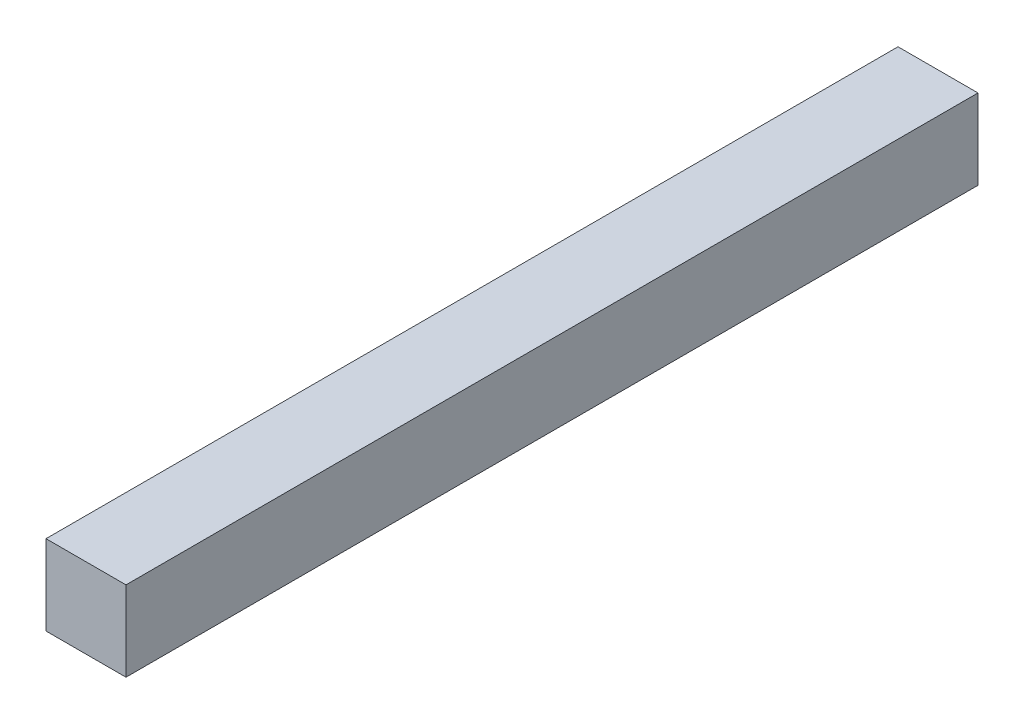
ISO-10303-21;
HEADER;
FILE_DESCRIPTION(('STEP AP214'),'2;1');
FILE_NAME('part.step','',(''),(''),'','','');
FILE_SCHEMA(('AUTOMOTIVE_DESIGN { 1 0 10303 214 1 1 1 1 }'));
ENDSEC;
DATA;
#1=APPLICATION_CONTEXT('core data for automotive mechanical design processes');
#2=APPLICATION_PROTOCOL_DEFINITION('international standard','automotive_design',2000,#1);
#3=PRODUCT_CONTEXT('',#1,'mechanical');
#4=PRODUCT('Part','Part','',(#3));
#5=PRODUCT_RELATED_PRODUCT_CATEGORY('part','',(#4));
#6=PRODUCT_DEFINITION_FORMATION('','',#4);
#7=PRODUCT_DEFINITION_CONTEXT('part definition',#1,'design');
#8=PRODUCT_DEFINITION('design','',#6,#7);
#9=PRODUCT_DEFINITION_SHAPE('','',#8);
#10=(LENGTH_UNIT() NAMED_UNIT(*) SI_UNIT(.MILLI.,.METRE.));
#11=(NAMED_UNIT(*) PLANE_ANGLE_UNIT() SI_UNIT($,.RADIAN.));
#12=(NAMED_UNIT(*) SI_UNIT($,.STERADIAN.) SOLID_ANGLE_UNIT());
#13=UNCERTAINTY_MEASURE_WITH_UNIT(LENGTH_MEASURE(1.E-05),#10,'distance_accuracy_value','');
#14=(GEOMETRIC_REPRESENTATION_CONTEXT(3) GLOBAL_UNCERTAINTY_ASSIGNED_CONTEXT((#13)) GLOBAL_UNIT_ASSIGNED_CONTEXT((#10,
#11,#12)) REPRESENTATION_CONTEXT('',''));
#15=CARTESIAN_POINT('',(0.,0.,0.));
#16=DIRECTION('',(0.,0.,1.));
#17=DIRECTION('',(1.,0.,0.));
#18=AXIS2_PLACEMENT_3D('',#15,#16,#17);
#19=CARTESIAN_POINT('',(0.009999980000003,0.009999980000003,0.));
#20=DIRECTION('',(1.,0.,0.));
#21=DIRECTION('',(0.,0.,-1.));
#22=AXIS2_PLACEMENT_3D('',#19,#20,#21);
#23=PLANE('',#22);
#24=DIRECTION('',(0.,0.,-1.));
#25=VECTOR('',#24,1.);
#26=CARTESIAN_POINT('',(0.009999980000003,-2.539999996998E-06,0.));
#27=LINE('',#26,#25);
#28=CARTESIAN_POINT('',(0.009999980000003,-2.53999999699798E-06,0.));
#29=VERTEX_POINT('',#28);
#30=CARTESIAN_POINT('',(0.009999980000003,-2.53999999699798E-06,0.10651998));
#31=VERTEX_POINT('',#30);
#32=EDGE_CURVE('E19',#29,#31,#27,.F.);
#33=ORIENTED_EDGE('',*,*,#32,.F.);
#34=DIRECTION('',(0.,1.,0.));
#35=VECTOR('',#34,1.);
#36=CARTESIAN_POINT('',(0.009999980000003,-2.539999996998E-06,0.));
#37=LINE('',#36,#35);
#38=CARTESIAN_POINT('',(0.009999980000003,0.009999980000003,0.));
#39=VERTEX_POINT('',#38);
#40=EDGE_CURVE('E79',#29,#39,#37,.T.);
#41=ORIENTED_EDGE('',*,*,#40,.T.);
#42=DIRECTION('',(0.,0.,1.));
#43=VECTOR('',#42,1.);
#44=CARTESIAN_POINT('',(0.009999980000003,0.009999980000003,0.));
#45=LINE('',#44,#43);
#46=CARTESIAN_POINT('',(0.009999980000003,0.009999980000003,0.10651998));
#47=VERTEX_POINT('',#46);
#48=EDGE_CURVE('E67',#47,#39,#45,.F.);
#49=ORIENTED_EDGE('',*,*,#48,.F.);
#50=DIRECTION('',(0.,1.,0.));
#51=VECTOR('',#50,1.);
#52=CARTESIAN_POINT('',(0.009999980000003,-2.539999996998E-06,0.10651998));
#53=LINE('',#52,#51);
#54=EDGE_CURVE('E55',#31,#47,#53,.T.);
#55=ORIENTED_EDGE('',*,*,#54,.F.);
#56=EDGE_LOOP('',(#33,#41,#49,#55));
#57=FACE_BOUND('',#56,.T.);
#58=ADVANCED_FACE('F16',(#57),#23,.T.);
#59=CARTESIAN_POINT('',(0.009999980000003,-2.539999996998E-06,0.));
#60=DIRECTION('',(0.,-1.,0.));
#61=DIRECTION('',(0.,0.,-1.));
#62=AXIS2_PLACEMENT_3D('',#59,#60,#61);
#63=PLANE('',#62);
#64=DIRECTION('',(0.,0.,1.));
#65=VECTOR('',#64,1.);
#66=CARTESIAN_POINT('',(0.,-2.539999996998E-06,0.));
#67=LINE('',#66,#65);
#68=CARTESIAN_POINT('',(0.,-2.539999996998E-06,0.));
#69=VERTEX_POINT('',#68);
#70=CARTESIAN_POINT('',(0.,-2.539999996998E-06,0.10651998));
#71=VERTEX_POINT('',#70);
#72=EDGE_CURVE('E82',#69,#71,#67,.T.);
#73=ORIENTED_EDGE('',*,*,#72,.F.);
#74=DIRECTION('',(1.,0.,0.));
#75=VECTOR('',#74,1.);
#76=CARTESIAN_POINT('',(0.,-2.539999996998E-06,0.));
#77=LINE('',#76,#75);
#78=EDGE_CURVE('E64',#69,#29,#77,.T.);
#79=ORIENTED_EDGE('',*,*,#78,.T.);
#80=ORIENTED_EDGE('',*,*,#32,.T.);
#81=DIRECTION('',(1.,0.,0.));
#82=VECTOR('',#81,1.);
#83=CARTESIAN_POINT('',(0.,-2.539999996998E-06,0.10651998));
#84=LINE('',#83,#82);
#85=EDGE_CURVE('E61',#71,#31,#84,.T.);
#86=ORIENTED_EDGE('',*,*,#85,.F.);
#87=EDGE_LOOP('',(#73,#79,#80,#86));
#88=FACE_BOUND('',#87,.T.);
#89=ADVANCED_FACE('F60',(#88),#63,.T.);
#90=CARTESIAN_POINT('',(0.,-2.539999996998E-06,0.10651998));
#91=DIRECTION('',(0.,0.,1.));
#92=DIRECTION('',(1.,0.,0.));
#93=AXIS2_PLACEMENT_3D('',#90,#91,#92);
#94=PLANE('',#93);
#95=DIRECTION('',(1.,0.,0.));
#96=VECTOR('',#95,1.);
#97=CARTESIAN_POINT('',(0.,0.009999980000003,0.10651998));
#98=LINE('',#97,#96);
#99=CARTESIAN_POINT('',(0.,0.009999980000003,0.10651998));
#100=VERTEX_POINT('',#99);
#101=EDGE_CURVE('E69',#100,#47,#98,.T.);
#102=ORIENTED_EDGE('',*,*,#101,.F.);
#103=DIRECTION('',(0.,1.,0.));
#104=VECTOR('',#103,1.);
#105=CARTESIAN_POINT('',(0.,-2.539999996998E-06,0.10651998));
#106=LINE('',#105,#104);
#107=EDGE_CURVE('E73',#71,#100,#106,.T.);
#108=ORIENTED_EDGE('',*,*,#107,.F.);
#109=ORIENTED_EDGE('',*,*,#85,.T.);
#110=ORIENTED_EDGE('',*,*,#54,.T.);
#111=EDGE_LOOP('',(#102,#108,#109,#110));
#112=FACE_BOUND('',#111,.T.);
#113=ADVANCED_FACE('F71',(#112),#94,.T.);
#114=CARTESIAN_POINT('',(0.,0.009999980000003,0.));
#115=DIRECTION('',(0.,1.,0.));
#116=DIRECTION('',(0.,0.,1.));
#117=AXIS2_PLACEMENT_3D('',#114,#115,#116);
#118=PLANE('',#117);
#119=ORIENTED_EDGE('',*,*,#48,.T.);
#120=DIRECTION('',(1.,0.,0.));
#121=VECTOR('',#120,1.);
#122=CARTESIAN_POINT('',(0.,0.009999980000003,0.));
#123=LINE('',#122,#121);
#124=CARTESIAN_POINT('',(0.,0.009999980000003,0.));
#125=VERTEX_POINT('',#124);
#126=EDGE_CURVE('E34',#39,#125,#123,.F.);
#127=ORIENTED_EDGE('',*,*,#126,.T.);
#128=DIRECTION('',(0.,0.,1.));
#129=VECTOR('',#128,1.);
#130=CARTESIAN_POINT('',(0.,0.009999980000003,0.));
#131=LINE('',#130,#129);
#132=EDGE_CURVE('E25',#100,#125,#131,.F.);
#133=ORIENTED_EDGE('',*,*,#132,.F.);
#134=ORIENTED_EDGE('',*,*,#101,.T.);
#135=EDGE_LOOP('',(#119,#127,#133,#134));
#136=FACE_BOUND('',#135,.T.);
#137=ADVANCED_FACE('F88',(#136),#118,.T.);
#138=CARTESIAN_POINT('',(0.,-2.539999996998E-06,0.));
#139=DIRECTION('',(0.,0.,1.));
#140=DIRECTION('',(1.,0.,0.));
#141=AXIS2_PLACEMENT_3D('',#138,#139,#140);
#142=PLANE('',#141);
#143=ORIENTED_EDGE('',*,*,#126,.F.);
#144=ORIENTED_EDGE('',*,*,#40,.F.);
#145=ORIENTED_EDGE('',*,*,#78,.F.);
#146=DIRECTION('',(0.,1.,0.));
#147=VECTOR('',#146,1.);
#148=CARTESIAN_POINT('',(0.,-2.539999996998E-06,0.));
#149=LINE('',#148,#147);
#150=EDGE_CURVE('E10',#125,#69,#149,.F.);
#151=ORIENTED_EDGE('',*,*,#150,.F.);
#152=EDGE_LOOP('',(#143,#144,#145,#151));
#153=FACE_BOUND('',#152,.T.);
#154=ADVANCED_FACE('F90',(#153),#142,.F.);
#155=CARTESIAN_POINT('',(0.,-2.539999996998E-06,0.));
#156=DIRECTION('',(-1.,0.,0.));
#157=DIRECTION('',(0.,0.,1.));
#158=AXIS2_PLACEMENT_3D('',#155,#156,#157);
#159=PLANE('',#158);
#160=ORIENTED_EDGE('',*,*,#132,.T.);
#161=ORIENTED_EDGE('',*,*,#150,.T.);
#162=ORIENTED_EDGE('',*,*,#72,.T.);
#163=ORIENTED_EDGE('',*,*,#107,.T.);
#164=EDGE_LOOP('',(#160,#161,#162,#163));
#165=FACE_BOUND('',#164,.T.);
#166=ADVANCED_FACE('F87',(#165),#159,.T.);
#167=CLOSED_SHELL('',(#58,#89,#113,#137,#154,#166));
#168=MANIFOLD_SOLID_BREP('B1',#167);
#169=ADVANCED_BREP_SHAPE_REPRESENTATION('',(#18,#168),#14);
#170=SHAPE_DEFINITION_REPRESENTATION(#9,#169);
ENDSEC;
END-ISO-10303-21;
